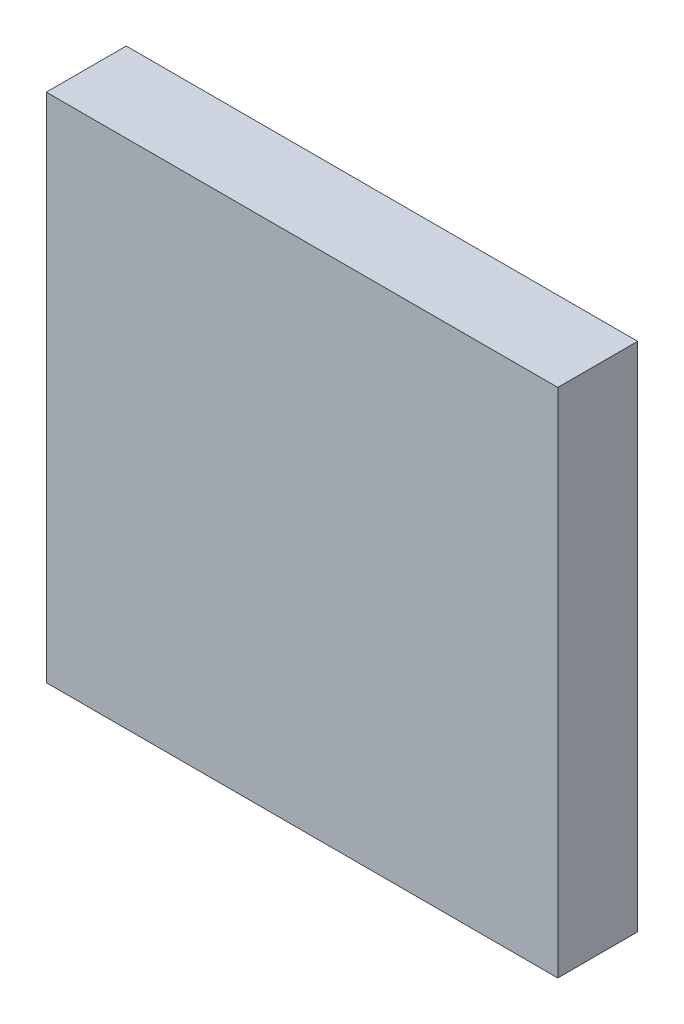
ISO-10303-21;
HEADER;
FILE_DESCRIPTION(('STEP AP214'),'2;1');
FILE_NAME('part.step','',(''),(''),'','','');
FILE_SCHEMA(('AUTOMOTIVE_DESIGN { 1 0 10303 214 1 1 1 1 }'));
ENDSEC;
DATA;
#1=APPLICATION_CONTEXT('core data for automotive mechanical design processes');
#2=APPLICATION_PROTOCOL_DEFINITION('international standard','automotive_design',2000,#1);
#3=PRODUCT_CONTEXT('',#1,'mechanical');
#4=PRODUCT('Part','Part','',(#3));
#5=PRODUCT_RELATED_PRODUCT_CATEGORY('part','',(#4));
#6=PRODUCT_DEFINITION_FORMATION('','',#4);
#7=PRODUCT_DEFINITION_CONTEXT('part definition',#1,'design');
#8=PRODUCT_DEFINITION('design','',#6,#7);
#9=PRODUCT_DEFINITION_SHAPE('','',#8);
#10=(LENGTH_UNIT() NAMED_UNIT(*) SI_UNIT(.MILLI.,.METRE.));
#11=(NAMED_UNIT(*) PLANE_ANGLE_UNIT() SI_UNIT($,.RADIAN.));
#12=(NAMED_UNIT(*) SI_UNIT($,.STERADIAN.) SOLID_ANGLE_UNIT());
#13=UNCERTAINTY_MEASURE_WITH_UNIT(LENGTH_MEASURE(1.E-05),#10,'distance_accuracy_value','');
#14=(GEOMETRIC_REPRESENTATION_CONTEXT(3) GLOBAL_UNCERTAINTY_ASSIGNED_CONTEXT((#13)) GLOBAL_UNIT_ASSIGNED_CONTEXT((#10,
#11,#12)) REPRESENTATION_CONTEXT('',''));
#15=CARTESIAN_POINT('',(0.,0.,0.));
#16=DIRECTION('',(0.,0.,1.));
#17=DIRECTION('',(1.,0.,0.));
#18=AXIS2_PLACEMENT_3D('',#15,#16,#17);
#19=CARTESIAN_POINT('',(0.,0.,12.5));
#20=DIRECTION('',(1.,0.,0.));
#21=DIRECTION('',(0.,0.,-1.));
#22=AXIS2_PLACEMENT_3D('',#19,#20,#21);
#23=PLANE('',#22);
#24=DIRECTION('',(0.,-1.,0.));
#25=VECTOR('',#24,1.);
#26=CARTESIAN_POINT('',(0.,0.,0.));
#27=LINE('',#26,#25);
#28=CARTESIAN_POINT('',(0.,80.,0.));
#29=VERTEX_POINT('',#28);
#30=CARTESIAN_POINT('',(0.,0.,0.));
#31=VERTEX_POINT('',#30);
#32=EDGE_CURVE('E94',#29,#31,#27,.T.);
#33=ORIENTED_EDGE('',*,*,#32,.T.);
#34=DIRECTION('',(0.,0.,-1.));
#35=VECTOR('',#34,1.);
#36=CARTESIAN_POINT('',(0.,0.,12.5));
#37=LINE('',#36,#35);
#38=CARTESIAN_POINT('',(0.,0.,12.5));
#39=VERTEX_POINT('',#38);
#40=EDGE_CURVE('E11',#39,#31,#37,.T.);
#41=ORIENTED_EDGE('',*,*,#40,.F.);
#42=DIRECTION('',(0.,-1.,0.));
#43=VECTOR('',#42,1.);
#44=CARTESIAN_POINT('',(0.,0.,12.5));
#45=LINE('',#44,#43);
#46=CARTESIAN_POINT('',(0.,80.,12.5));
#47=VERTEX_POINT('',#46);
#48=EDGE_CURVE('E82',#47,#39,#45,.T.);
#49=ORIENTED_EDGE('',*,*,#48,.F.);
#50=DIRECTION('',(0.,0.,-1.));
#51=VECTOR('',#50,1.);
#52=CARTESIAN_POINT('',(0.,80.,12.5));
#53=LINE('',#52,#51);
#54=EDGE_CURVE('E90',#47,#29,#53,.T.);
#55=ORIENTED_EDGE('',*,*,#54,.T.);
#56=EDGE_LOOP('',(#33,#41,#49,#55));
#57=FACE_BOUND('',#56,.T.);
#58=ADVANCED_FACE('F31',(#57),#23,.F.);
#59=CARTESIAN_POINT('',(0.,0.,12.5));
#60=DIRECTION('',(0.,1.,0.));
#61=DIRECTION('',(0.,0.,1.));
#62=AXIS2_PLACEMENT_3D('',#59,#60,#61);
#63=PLANE('',#62);
#64=DIRECTION('',(1.,0.,0.));
#65=VECTOR('',#64,1.);
#66=CARTESIAN_POINT('',(0.,0.,0.));
#67=LINE('',#66,#65);
#68=CARTESIAN_POINT('',(80.,0.,0.));
#69=VERTEX_POINT('',#68);
#70=EDGE_CURVE('E86',#31,#69,#67,.T.);
#71=ORIENTED_EDGE('',*,*,#70,.T.);
#72=DIRECTION('',(0.,0.,-1.));
#73=VECTOR('',#72,1.);
#74=CARTESIAN_POINT('',(80.,0.,12.5));
#75=LINE('',#74,#73);
#76=CARTESIAN_POINT('',(80.,0.,12.5));
#77=VERTEX_POINT('',#76);
#78=EDGE_CURVE('E39',#77,#69,#75,.T.);
#79=ORIENTED_EDGE('',*,*,#78,.F.);
#80=DIRECTION('',(1.,0.,0.));
#81=VECTOR('',#80,1.);
#82=CARTESIAN_POINT('',(0.,0.,12.5));
#83=LINE('',#82,#81);
#84=EDGE_CURVE('E77',#39,#77,#83,.T.);
#85=ORIENTED_EDGE('',*,*,#84,.F.);
#86=ORIENTED_EDGE('',*,*,#40,.T.);
#87=EDGE_LOOP('',(#71,#79,#85,#86));
#88=FACE_BOUND('',#87,.T.);
#89=ADVANCED_FACE('F85',(#88),#63,.F.);
#90=CARTESIAN_POINT('',(80.,0.,12.5));
#91=DIRECTION('',(-1.,0.,0.));
#92=DIRECTION('',(0.,0.,1.));
#93=AXIS2_PLACEMENT_3D('',#90,#91,#92);
#94=PLANE('',#93);
#95=DIRECTION('',(0.,1.,0.));
#96=VECTOR('',#95,1.);
#97=CARTESIAN_POINT('',(80.,0.,0.));
#98=LINE('',#97,#96);
#99=CARTESIAN_POINT('',(80.,80.,0.));
#100=VERTEX_POINT('',#99);
#101=EDGE_CURVE('E64',#69,#100,#98,.T.);
#102=ORIENTED_EDGE('',*,*,#101,.T.);
#103=DIRECTION('',(0.,0.,-1.));
#104=VECTOR('',#103,1.);
#105=CARTESIAN_POINT('',(80.,80.,12.5));
#106=LINE('',#105,#104);
#107=CARTESIAN_POINT('',(80.,80.,12.5));
#108=VERTEX_POINT('',#107);
#109=EDGE_CURVE('E87',#108,#100,#106,.T.);
#110=ORIENTED_EDGE('',*,*,#109,.F.);
#111=DIRECTION('',(0.,1.,0.));
#112=VECTOR('',#111,1.);
#113=CARTESIAN_POINT('',(80.,0.,12.5));
#114=LINE('',#113,#112);
#115=EDGE_CURVE('E80',#77,#108,#114,.T.);
#116=ORIENTED_EDGE('',*,*,#115,.F.);
#117=ORIENTED_EDGE('',*,*,#78,.T.);
#118=EDGE_LOOP('',(#102,#110,#116,#117));
#119=FACE_BOUND('',#118,.T.);
#120=ADVANCED_FACE('F88',(#119),#94,.F.);
#121=CARTESIAN_POINT('',(0.,80.,12.5));
#122=DIRECTION('',(0.,-1.,0.));
#123=DIRECTION('',(0.,0.,-1.));
#124=AXIS2_PLACEMENT_3D('',#121,#122,#123);
#125=PLANE('',#124);
#126=DIRECTION('',(-1.,0.,0.));
#127=VECTOR('',#126,1.);
#128=CARTESIAN_POINT('',(0.,80.,0.));
#129=LINE('',#128,#127);
#130=EDGE_CURVE('E70',#100,#29,#129,.T.);
#131=ORIENTED_EDGE('',*,*,#130,.T.);
#132=ORIENTED_EDGE('',*,*,#54,.F.);
#133=DIRECTION('',(-1.,0.,0.));
#134=VECTOR('',#133,1.);
#135=CARTESIAN_POINT('',(0.,80.,12.5));
#136=LINE('',#135,#134);
#137=EDGE_CURVE('E47',#108,#47,#136,.T.);
#138=ORIENTED_EDGE('',*,*,#137,.F.);
#139=ORIENTED_EDGE('',*,*,#109,.T.);
#140=EDGE_LOOP('',(#131,#132,#138,#139));
#141=FACE_BOUND('',#140,.T.);
#142=ADVANCED_FACE('F101',(#141),#125,.F.);
#143=CARTESIAN_POINT('',(0.,80.,12.5));
#144=DIRECTION('',(0.,0.,-1.));
#145=DIRECTION('',(-1.,0.,0.));
#146=AXIS2_PLACEMENT_3D('',#143,#144,#145);
#147=PLANE('',#146);
#148=ORIENTED_EDGE('',*,*,#48,.T.);
#149=ORIENTED_EDGE('',*,*,#84,.T.);
#150=ORIENTED_EDGE('',*,*,#115,.T.);
#151=ORIENTED_EDGE('',*,*,#137,.T.);
#152=EDGE_LOOP('',(#148,#149,#150,#151));
#153=FACE_BOUND('',#152,.T.);
#154=ADVANCED_FACE('F78',(#153),#147,.F.);
#155=CARTESIAN_POINT('',(0.,80.,0.));
#156=DIRECTION('',(0.,0.,-1.));
#157=DIRECTION('',(-1.,0.,0.));
#158=AXIS2_PLACEMENT_3D('',#155,#156,#157);
#159=PLANE('',#158);
#160=ORIENTED_EDGE('',*,*,#32,.F.);
#161=ORIENTED_EDGE('',*,*,#130,.F.);
#162=ORIENTED_EDGE('',*,*,#101,.F.);
#163=ORIENTED_EDGE('',*,*,#70,.F.);
#164=EDGE_LOOP('',(#160,#161,#162,#163));
#165=FACE_BOUND('',#164,.T.);
#166=ADVANCED_FACE('F104',(#165),#159,.T.);
#167=CLOSED_SHELL('',(#58,#89,#120,#142,#154,#166));
#168=MANIFOLD_SOLID_BREP('B2',#167);
#169=ADVANCED_BREP_SHAPE_REPRESENTATION('',(#18,#168),#14);
#170=SHAPE_DEFINITION_REPRESENTATION(#9,#169);
ENDSEC;
END-ISO-10303-21;
